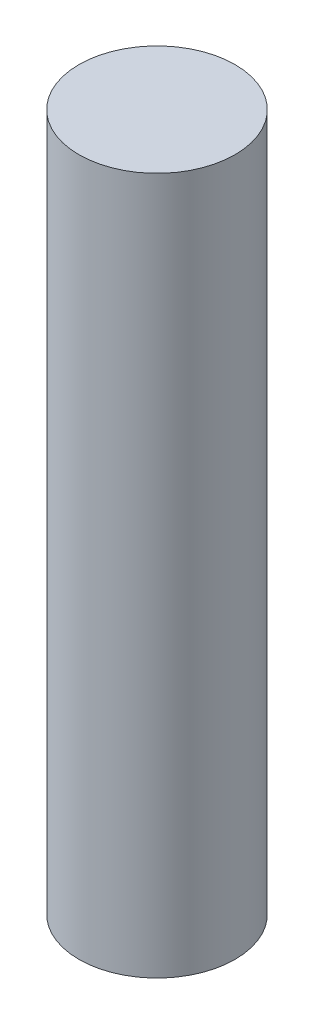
from build123d import *

# Parameters (mm, degrees)
SKETCH1_R           = 1.4224
BOSS_EXTRUDE1_DEPTH = 12.7


with BuildPart() as part:
    # Sketch1 → Boss-Extrude1 (new body)
    with BuildSketch(Plane(origin=(0, 0, 0), x_dir=(1, 0, 0), z_dir=(0, 1, 0))):
        with Locations(Location((0, 0, 0), (0, 0, 270))):
            Circle(SKETCH1_R)
    extrude(amount=BOSS_EXTRUDE1_DEPTH)


solid = part.part
